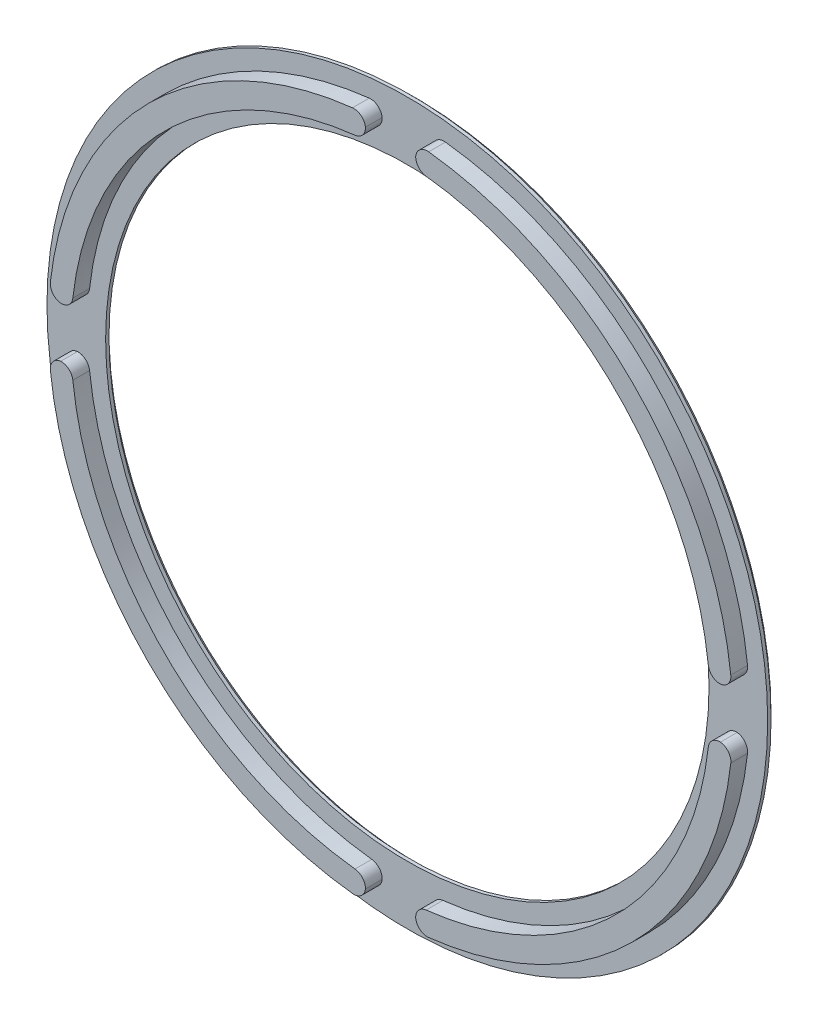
ISO-10303-21;
HEADER;
FILE_DESCRIPTION(('STEP AP214'),'2;1');
FILE_NAME('part.step','',(''),(''),'','','');
FILE_SCHEMA(('AUTOMOTIVE_DESIGN { 1 0 10303 214 1 1 1 1 }'));
ENDSEC;
DATA;
#1=APPLICATION_CONTEXT('core data for automotive mechanical design processes');
#2=APPLICATION_PROTOCOL_DEFINITION('international standard','automotive_design',2000,#1);
#3=PRODUCT_CONTEXT('',#1,'mechanical');
#4=PRODUCT('Part','Part','',(#3));
#5=PRODUCT_RELATED_PRODUCT_CATEGORY('part','',(#4));
#6=PRODUCT_DEFINITION_FORMATION('','',#4);
#7=PRODUCT_DEFINITION_CONTEXT('part definition',#1,'design');
#8=PRODUCT_DEFINITION('design','',#6,#7);
#9=PRODUCT_DEFINITION_SHAPE('','',#8);
#10=(LENGTH_UNIT() NAMED_UNIT(*) SI_UNIT(.MILLI.,.METRE.));
#11=(NAMED_UNIT(*) PLANE_ANGLE_UNIT() SI_UNIT($,.RADIAN.));
#12=(NAMED_UNIT(*) SI_UNIT($,.STERADIAN.) SOLID_ANGLE_UNIT());
#13=UNCERTAINTY_MEASURE_WITH_UNIT(LENGTH_MEASURE(1.E-05),#10,'distance_accuracy_value','');
#14=(GEOMETRIC_REPRESENTATION_CONTEXT(3) GLOBAL_UNCERTAINTY_ASSIGNED_CONTEXT((#13)) GLOBAL_UNIT_ASSIGNED_CONTEXT((#10,
#11,#12)) REPRESENTATION_CONTEXT('',''));
#15=CARTESIAN_POINT('',(0.,0.,0.));
#16=DIRECTION('',(0.,0.,1.));
#17=DIRECTION('',(1.,0.,0.));
#18=AXIS2_PLACEMENT_3D('',#15,#16,#17);
#19=CARTESIAN_POINT('',(0.,0.,0.9));
#20=DIRECTION('',(0.,0.,1.));
#21=DIRECTION('',(1.,0.,0.));
#22=AXIS2_PLACEMENT_3D('',#19,#20,#21);
#23=PLANE('',#22);
#24=CARTESIAN_POINT('',(0.,0.,0.9));
#25=DIRECTION('',(0.,0.,1.));
#26=DIRECTION('',(1.,0.,0.));
#27=AXIS2_PLACEMENT_3D('',#24,#25,#26);
#28=CIRCLE('',#27,43.);
#29=CARTESIAN_POINT('',(43.,0.,0.9));
#30=VERTEX_POINT('',#29);
#31=EDGE_CURVE('E381',#30,#30,#28,.T.);
#32=ORIENTED_EDGE('',*,*,#31,.T.);
#33=EDGE_LOOP('',(#32));
#34=FACE_BOUND('',#33,.T.);
#35=CARTESIAN_POINT('',(0.,0.,0.9));
#36=DIRECTION('',(0.,0.,1.));
#37=DIRECTION('',(1.,0.,0.));
#38=AXIS2_PLACEMENT_3D('',#35,#36,#37);
#39=CIRCLE('',#38,36.);
#40=CARTESIAN_POINT('',(36.,0.,0.9));
#41=VERTEX_POINT('',#40);
#42=EDGE_CURVE('E369',#41,#41,#39,.T.);
#43=ORIENTED_EDGE('',*,*,#42,.F.);
#44=EDGE_LOOP('',(#43));
#45=FACE_BOUND('',#44,.T.);
#46=CARTESIAN_POINT('',(39.2049488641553,4.39027158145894,0.9));
#47=DIRECTION('',(0.,0.,1.));
#48=DIRECTION('',(1.,0.,0.));
#49=AXIS2_PLACEMENT_3D('',#46,#47,#48);
#50=CIRCLE('',#49,1.4);
#51=CARTESIAN_POINT('',(40.5962524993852,4.54607336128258,0.9));
#52=VERTEX_POINT('',#51);
#53=CARTESIAN_POINT('',(39.3610969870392,2.99900677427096,0.9));
#54=VERTEX_POINT('',#53);
#55=EDGE_CURVE('E63',#52,#54,#50,.F.);
#56=ORIENTED_EDGE('',*,*,#55,.T.);
#57=CARTESIAN_POINT('',(39.3047227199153,4.39787129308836,0.9));
#58=DIRECTION('',(0.,0.,1.));
#59=DIRECTION('',(1.,0.,0.));
#60=AXIS2_PLACEMENT_3D('',#57,#58,#59);
#61=CIRCLE('',#60,1.4);
#62=CARTESIAN_POINT('',(37.9134051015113,4.24219443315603,0.9));
#63=VERTEX_POINT('',#62);
#64=EDGE_CURVE('E50',#54,#63,#61,.F.);
#65=ORIENTED_EDGE('',*,*,#64,.T.);
#66=CARTESIAN_POINT('',(0.,0.,0.9));
#67=DIRECTION('',(0.,0.,1.));
#68=DIRECTION('',(1.,0.,0.));
#69=AXIS2_PLACEMENT_3D('',#66,#67,#68);
#70=CIRCLE('',#69,38.15);
#71=CARTESIAN_POINT('',(4.24219443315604,37.9134051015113,0.9));
#72=VERTEX_POINT('',#71);
#73=EDGE_CURVE('E371',#72,#63,#70,.F.);
#74=ORIENTED_EDGE('',*,*,#73,.F.);
#75=CARTESIAN_POINT('',(4.39787129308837,39.3047227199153,0.9));
#76=DIRECTION('',(0.,0.,1.));
#77=DIRECTION('',(1.,0.,0.));
#78=AXIS2_PLACEMENT_3D('',#75,#76,#77);
#79=CIRCLE('',#78,1.4);
#80=CARTESIAN_POINT('',(2.99900677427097,39.3610969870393,0.9));
#81=VERTEX_POINT('',#80);
#82=EDGE_CURVE('E11',#72,#81,#79,.F.);
#83=ORIENTED_EDGE('',*,*,#82,.T.);
#84=CARTESIAN_POINT('',(4.39027158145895,39.2049488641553,0.9));
#85=DIRECTION('',(0.,0.,1.));
#86=DIRECTION('',(1.,0.,0.));
#87=AXIS2_PLACEMENT_3D('',#84,#85,#86);
#88=CIRCLE('',#87,1.4);
#89=CARTESIAN_POINT('',(4.54607336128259,40.5962524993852,0.9));
#90=VERTEX_POINT('',#89);
#91=EDGE_CURVE('E322',#81,#90,#88,.F.);
#92=ORIENTED_EDGE('',*,*,#91,.T.);
#93=CARTESIAN_POINT('',(0.,0.,0.9));
#94=DIRECTION('',(0.,0.,1.));
#95=DIRECTION('',(1.,0.,0.));
#96=AXIS2_PLACEMENT_3D('',#93,#94,#95);
#97=CIRCLE('',#96,40.85);
#98=EDGE_CURVE('E366',#90,#52,#97,.F.);
#99=ORIENTED_EDGE('',*,*,#98,.T.);
#100=EDGE_LOOP('',(#56,#65,#74,#83,#92,#99));
#101=FACE_BOUND('',#100,.T.);
#102=CARTESIAN_POINT('',(4.39027158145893,-39.2049488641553,0.9));
#103=DIRECTION('',(0.,0.,1.));
#104=DIRECTION('',(1.,0.,0.));
#105=AXIS2_PLACEMENT_3D('',#102,#103,#104);
#106=CIRCLE('',#105,1.4);
#107=CARTESIAN_POINT('',(4.54607336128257,-40.5962524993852,0.9));
#108=VERTEX_POINT('',#107);
#109=CARTESIAN_POINT('',(2.99900677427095,-39.3610969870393,0.9));
#110=VERTEX_POINT('',#109);
#111=EDGE_CURVE('E313',#108,#110,#106,.F.);
#112=ORIENTED_EDGE('',*,*,#111,.T.);
#113=CARTESIAN_POINT('',(4.39787129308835,-39.3047227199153,0.9));
#114=DIRECTION('',(0.,0.,1.));
#115=DIRECTION('',(1.,0.,0.));
#116=AXIS2_PLACEMENT_3D('',#113,#114,#115);
#117=CIRCLE('',#116,1.4);
#118=CARTESIAN_POINT('',(4.24219443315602,-37.9134051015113,0.9));
#119=VERTEX_POINT('',#118);
#120=EDGE_CURVE('E319',#110,#119,#117,.F.);
#121=ORIENTED_EDGE('',*,*,#120,.T.);
#122=CARTESIAN_POINT('',(0.,0.,0.9));
#123=DIRECTION('',(0.,0.,1.));
#124=DIRECTION('',(1.,0.,0.));
#125=AXIS2_PLACEMENT_3D('',#122,#123,#124);
#126=CIRCLE('',#125,38.15);
#127=CARTESIAN_POINT('',(37.9134051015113,-4.24219443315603,0.9));
#128=VERTEX_POINT('',#127);
#129=EDGE_CURVE('E453',#128,#119,#126,.F.);
#130=ORIENTED_EDGE('',*,*,#129,.F.);
#131=CARTESIAN_POINT('',(39.3047227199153,-4.39787129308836,0.9));
#132=DIRECTION('',(0.,0.,1.));
#133=DIRECTION('',(1.,0.,0.));
#134=AXIS2_PLACEMENT_3D('',#131,#132,#133);
#135=CIRCLE('',#134,1.4);
#136=CARTESIAN_POINT('',(39.3610969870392,-2.99900677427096,0.9));
#137=VERTEX_POINT('',#136);
#138=EDGE_CURVE('E317',#128,#137,#135,.F.);
#139=ORIENTED_EDGE('',*,*,#138,.T.);
#140=CARTESIAN_POINT('',(39.2049488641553,-4.39027158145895,0.9));
#141=DIRECTION('',(0.,0.,1.));
#142=DIRECTION('',(1.,0.,0.));
#143=AXIS2_PLACEMENT_3D('',#140,#141,#142);
#144=CIRCLE('',#143,1.4);
#145=CARTESIAN_POINT('',(40.5962524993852,-4.54607336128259,0.9));
#146=VERTEX_POINT('',#145);
#147=EDGE_CURVE('E315',#137,#146,#144,.F.);
#148=ORIENTED_EDGE('',*,*,#147,.T.);
#149=CARTESIAN_POINT('',(0.,0.,0.9));
#150=DIRECTION('',(0.,0.,1.));
#151=DIRECTION('',(1.,0.,0.));
#152=AXIS2_PLACEMENT_3D('',#149,#150,#151);
#153=CIRCLE('',#152,40.85);
#154=EDGE_CURVE('E374',#146,#108,#153,.F.);
#155=ORIENTED_EDGE('',*,*,#154,.T.);
#156=EDGE_LOOP('',(#112,#121,#130,#139,#148,#155));
#157=FACE_BOUND('',#156,.T.);
#158=CARTESIAN_POINT('',(-39.2049488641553,-4.39027158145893,0.9));
#159=DIRECTION('',(0.,0.,1.));
#160=DIRECTION('',(1.,0.,0.));
#161=AXIS2_PLACEMENT_3D('',#158,#159,#160);
#162=CIRCLE('',#161,1.4);
#163=CARTESIAN_POINT('',(-40.5962524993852,-4.54607336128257,0.9));
#164=VERTEX_POINT('',#163);
#165=CARTESIAN_POINT('',(-39.3610969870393,-2.99900677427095,0.9));
#166=VERTEX_POINT('',#165);
#167=EDGE_CURVE('E305',#164,#166,#162,.F.);
#168=ORIENTED_EDGE('',*,*,#167,.T.);
#169=CARTESIAN_POINT('',(-39.3047227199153,-4.39787129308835,0.9));
#170=DIRECTION('',(0.,0.,1.));
#171=DIRECTION('',(1.,0.,0.));
#172=AXIS2_PLACEMENT_3D('',#169,#170,#171);
#173=CIRCLE('',#172,1.4);
#174=CARTESIAN_POINT('',(-37.9134051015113,-4.24219443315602,0.9));
#175=VERTEX_POINT('',#174);
#176=EDGE_CURVE('E311',#166,#175,#173,.F.);
#177=ORIENTED_EDGE('',*,*,#176,.T.);
#178=CARTESIAN_POINT('',(0.,0.,0.9));
#179=DIRECTION('',(0.,0.,1.));
#180=DIRECTION('',(1.,0.,0.));
#181=AXIS2_PLACEMENT_3D('',#178,#179,#180);
#182=CIRCLE('',#181,38.15);
#183=CARTESIAN_POINT('',(-4.24219443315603,-37.9134051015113,0.9));
#184=VERTEX_POINT('',#183);
#185=EDGE_CURVE('E459',#184,#175,#182,.F.);
#186=ORIENTED_EDGE('',*,*,#185,.F.);
#187=CARTESIAN_POINT('',(-4.39787129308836,-39.3047227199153,0.9));
#188=DIRECTION('',(0.,0.,1.));
#189=DIRECTION('',(1.,0.,0.));
#190=AXIS2_PLACEMENT_3D('',#187,#188,#189);
#191=CIRCLE('',#190,1.4);
#192=CARTESIAN_POINT('',(-2.99900677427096,-39.3610969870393,0.9));
#193=VERTEX_POINT('',#192);
#194=EDGE_CURVE('E309',#184,#193,#191,.F.);
#195=ORIENTED_EDGE('',*,*,#194,.T.);
#196=CARTESIAN_POINT('',(-4.39027158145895,-39.2049488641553,0.9));
#197=DIRECTION('',(0.,0.,1.));
#198=DIRECTION('',(1.,0.,0.));
#199=AXIS2_PLACEMENT_3D('',#196,#197,#198);
#200=CIRCLE('',#199,1.4);
#201=CARTESIAN_POINT('',(-4.54607336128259,-40.5962524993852,0.9));
#202=VERTEX_POINT('',#201);
#203=EDGE_CURVE('E307',#193,#202,#200,.F.);
#204=ORIENTED_EDGE('',*,*,#203,.T.);
#205=CARTESIAN_POINT('',(0.,0.,0.9));
#206=DIRECTION('',(0.,0.,1.));
#207=DIRECTION('',(1.,0.,0.));
#208=AXIS2_PLACEMENT_3D('',#205,#206,#207);
#209=CIRCLE('',#208,40.85);
#210=EDGE_CURVE('E434',#202,#164,#209,.F.);
#211=ORIENTED_EDGE('',*,*,#210,.T.);
#212=EDGE_LOOP('',(#168,#177,#186,#195,#204,#211));
#213=FACE_BOUND('',#212,.T.);
#214=CARTESIAN_POINT('',(-4.39027158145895,39.2049488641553,0.9));
#215=DIRECTION('',(0.,0.,1.));
#216=DIRECTION('',(1.,0.,0.));
#217=AXIS2_PLACEMENT_3D('',#214,#215,#216);
#218=CIRCLE('',#217,1.4);
#219=CARTESIAN_POINT('',(-4.54607336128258,40.5962524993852,0.9));
#220=VERTEX_POINT('',#219);
#221=CARTESIAN_POINT('',(-2.99900677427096,39.3610969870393,0.9));
#222=VERTEX_POINT('',#221);
#223=EDGE_CURVE('E212',#220,#222,#218,.F.);
#224=ORIENTED_EDGE('',*,*,#223,.T.);
#225=CARTESIAN_POINT('',(-4.39787129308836,39.3047227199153,0.9));
#226=DIRECTION('',(0.,0.,1.));
#227=DIRECTION('',(1.,0.,0.));
#228=AXIS2_PLACEMENT_3D('',#225,#226,#227);
#229=CIRCLE('',#228,1.4);
#230=CARTESIAN_POINT('',(-4.24219443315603,37.9134051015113,0.9));
#231=VERTEX_POINT('',#230);
#232=EDGE_CURVE('E303',#222,#231,#229,.F.);
#233=ORIENTED_EDGE('',*,*,#232,.T.);
#234=CARTESIAN_POINT('',(0.,0.,0.9));
#235=DIRECTION('',(0.,0.,1.));
#236=DIRECTION('',(1.,0.,0.));
#237=AXIS2_PLACEMENT_3D('',#234,#235,#236);
#238=CIRCLE('',#237,38.15);
#239=CARTESIAN_POINT('',(-37.9134051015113,4.24219443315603,0.9));
#240=VERTEX_POINT('',#239);
#241=EDGE_CURVE('E224',#240,#231,#238,.F.);
#242=ORIENTED_EDGE('',*,*,#241,.F.);
#243=CARTESIAN_POINT('',(-39.3047227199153,4.39787129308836,0.9));
#244=DIRECTION('',(0.,0.,1.));
#245=DIRECTION('',(1.,0.,0.));
#246=AXIS2_PLACEMENT_3D('',#243,#244,#245);
#247=CIRCLE('',#246,1.4);
#248=CARTESIAN_POINT('',(-39.3610969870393,2.99900677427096,0.9));
#249=VERTEX_POINT('',#248);
#250=EDGE_CURVE('E207',#240,#249,#247,.F.);
#251=ORIENTED_EDGE('',*,*,#250,.T.);
#252=CARTESIAN_POINT('',(-39.2049488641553,4.39027158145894,0.9));
#253=DIRECTION('',(0.,0.,1.));
#254=DIRECTION('',(1.,0.,0.));
#255=AXIS2_PLACEMENT_3D('',#252,#253,#254);
#256=CIRCLE('',#255,1.4);
#257=CARTESIAN_POINT('',(-40.5962524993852,4.54607336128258,0.9));
#258=VERTEX_POINT('',#257);
#259=EDGE_CURVE('E202',#249,#258,#256,.F.);
#260=ORIENTED_EDGE('',*,*,#259,.T.);
#261=CARTESIAN_POINT('',(0.,0.,0.9));
#262=DIRECTION('',(0.,0.,1.));
#263=DIRECTION('',(1.,0.,0.));
#264=AXIS2_PLACEMENT_3D('',#261,#262,#263);
#265=CIRCLE('',#264,40.85);
#266=EDGE_CURVE('E204',#258,#220,#265,.F.);
#267=ORIENTED_EDGE('',*,*,#266,.T.);
#268=EDGE_LOOP('',(#224,#233,#242,#251,#260,#267));
#269=FACE_BOUND('',#268,.T.);
#270=ADVANCED_FACE('F41',(#34,#45,#101,#157,#213,#269),#23,.T.);
#271=CARTESIAN_POINT('',(0.,0.,0.));
#272=DIRECTION('',(0.,0.,1.));
#273=DIRECTION('',(1.,0.,0.));
#274=AXIS2_PLACEMENT_3D('',#271,#272,#273);
#275=PLANE('',#274);
#276=CARTESIAN_POINT('',(0.,0.,0.));
#277=DIRECTION('',(0.,0.,1.));
#278=DIRECTION('',(1.,0.,0.));
#279=AXIS2_PLACEMENT_3D('',#276,#277,#278);
#280=CIRCLE('',#279,36.5);
#281=CARTESIAN_POINT('',(36.5,0.,0.));
#282=VERTEX_POINT('',#281);
#283=EDGE_CURVE('E387',#282,#282,#280,.T.);
#284=ORIENTED_EDGE('',*,*,#283,.T.);
#285=EDGE_LOOP('',(#284));
#286=FACE_BOUND('',#285,.T.);
#287=CARTESIAN_POINT('',(0.,0.,0.));
#288=DIRECTION('',(0.,0.,1.));
#289=DIRECTION('',(1.,0.,0.));
#290=AXIS2_PLACEMENT_3D('',#287,#288,#289);
#291=CIRCLE('',#290,42.5);
#292=CARTESIAN_POINT('',(42.5,0.,0.));
#293=VERTEX_POINT('',#292);
#294=EDGE_CURVE('E384',#293,#293,#291,.F.);
#295=ORIENTED_EDGE('',*,*,#294,.T.);
#296=EDGE_LOOP('',(#295));
#297=FACE_BOUND('',#296,.T.);
#298=ADVANCED_FACE('F403',(#286,#297),#275,.F.);
#299=CARTESIAN_POINT('',(0.,0.,0.9));
#300=DIRECTION('',(0.,0.,-1.));
#301=DIRECTION('',(-1.,0.,0.));
#302=AXIS2_PLACEMENT_3D('',#299,#300,#301);
#303=CYLINDRICAL_SURFACE('',#302,43.);
#304=CARTESIAN_POINT('',(0.,0.,0.500000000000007));
#305=DIRECTION('',(0.,0.,1.));
#306=DIRECTION('',(1.,0.,0.));
#307=AXIS2_PLACEMENT_3D('',#304,#305,#306);
#308=CIRCLE('',#307,43.);
#309=CARTESIAN_POINT('',(43.,0.,0.500000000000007));
#310=VERTEX_POINT('',#309);
#311=EDGE_CURVE('E228',#310,#310,#308,.T.);
#312=ORIENTED_EDGE('',*,*,#311,.T.);
#313=EDGE_LOOP('',(#312));
#314=FACE_BOUND('',#313,.T.);
#315=ORIENTED_EDGE('',*,*,#31,.F.);
#316=EDGE_LOOP('',(#315));
#317=FACE_BOUND('',#316,.T.);
#318=ADVANCED_FACE('F406',(#314,#317),#303,.T.);
#319=CARTESIAN_POINT('',(0.,0.,0.9));
#320=DIRECTION('',(0.,0.,-1.));
#321=DIRECTION('',(-1.,0.,0.));
#322=AXIS2_PLACEMENT_3D('',#319,#320,#321);
#323=CYLINDRICAL_SURFACE('',#322,36.);
#324=CARTESIAN_POINT('',(0.,0.,0.499999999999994));
#325=DIRECTION('',(0.,0.,1.));
#326=DIRECTION('',(1.,0.,0.));
#327=AXIS2_PLACEMENT_3D('',#324,#325,#326);
#328=CIRCLE('',#327,36.);
#329=CARTESIAN_POINT('',(36.,0.,0.499999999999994));
#330=VERTEX_POINT('',#329);
#331=EDGE_CURVE('E233',#330,#330,#328,.F.);
#332=ORIENTED_EDGE('',*,*,#331,.T.);
#333=EDGE_LOOP('',(#332));
#334=FACE_BOUND('',#333,.T.);
#335=ORIENTED_EDGE('',*,*,#42,.T.);
#336=EDGE_LOOP('',(#335));
#337=FACE_BOUND('',#336,.T.);
#338=ADVANCED_FACE('F392',(#334,#337),#323,.F.);
#339=CARTESIAN_POINT('',(0.,0.,2.9));
#340=DIRECTION('',(0.,0.,-1.));
#341=DIRECTION('',(-1.,0.,0.));
#342=AXIS2_PLACEMENT_3D('',#339,#340,#341);
#343=CYLINDRICAL_SURFACE('',#342,38.15);
#344=ORIENTED_EDGE('',*,*,#73,.T.);
#345=DIRECTION('',(0.,0.,-1.));
#346=VECTOR('',#345,1.);
#347=CARTESIAN_POINT('',(37.9134051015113,4.24219443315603,2.9));
#348=LINE('',#347,#346);
#349=CARTESIAN_POINT('',(37.9134051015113,4.24219443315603,2.9));
#350=VERTEX_POINT('',#349);
#351=EDGE_CURVE('E299',#63,#350,#348,.F.);
#352=ORIENTED_EDGE('',*,*,#351,.T.);
#353=CARTESIAN_POINT('',(0.,0.,2.9));
#354=DIRECTION('',(0.,0.,1.));
#355=DIRECTION('',(1.,0.,0.));
#356=AXIS2_PLACEMENT_3D('',#353,#354,#355);
#357=CIRCLE('',#356,38.15);
#358=CARTESIAN_POINT('',(4.24219443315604,37.9134051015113,2.9));
#359=VERTEX_POINT('',#358);
#360=EDGE_CURVE('E358',#359,#350,#357,.F.);
#361=ORIENTED_EDGE('',*,*,#360,.F.);
#362=DIRECTION('',(0.,0.,-1.));
#363=VECTOR('',#362,1.);
#364=CARTESIAN_POINT('',(4.24219443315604,37.9134051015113,2.9));
#365=LINE('',#364,#363);
#366=EDGE_CURVE('E297',#359,#72,#365,.T.);
#367=ORIENTED_EDGE('',*,*,#366,.T.);
#368=EDGE_LOOP('',(#344,#352,#361,#367));
#369=FACE_BOUND('',#368,.T.);
#370=ADVANCED_FACE('F363',(#369),#343,.F.);
#371=CARTESIAN_POINT('',(0.,0.,2.9));
#372=DIRECTION('',(0.,0.,-1.));
#373=DIRECTION('',(-1.,0.,0.));
#374=AXIS2_PLACEMENT_3D('',#371,#372,#373);
#375=CYLINDRICAL_SURFACE('',#374,40.85);
#376=CARTESIAN_POINT('',(0.,0.,2.9));
#377=DIRECTION('',(0.,0.,1.));
#378=DIRECTION('',(1.,0.,0.));
#379=AXIS2_PLACEMENT_3D('',#376,#377,#378);
#380=CIRCLE('',#379,40.85);
#381=CARTESIAN_POINT('',(4.54607336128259,40.5962524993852,2.9));
#382=VERTEX_POINT('',#381);
#383=CARTESIAN_POINT('',(40.5962524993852,4.54607336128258,2.9));
#384=VERTEX_POINT('',#383);
#385=EDGE_CURVE('E365',#382,#384,#380,.F.);
#386=ORIENTED_EDGE('',*,*,#385,.T.);
#387=DIRECTION('',(0.,0.,-1.));
#388=VECTOR('',#387,1.);
#389=CARTESIAN_POINT('',(40.5962524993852,4.54607336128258,2.9));
#390=LINE('',#389,#388);
#391=EDGE_CURVE('E286',#384,#52,#390,.T.);
#392=ORIENTED_EDGE('',*,*,#391,.T.);
#393=ORIENTED_EDGE('',*,*,#98,.F.);
#394=DIRECTION('',(0.,0.,-1.));
#395=VECTOR('',#394,1.);
#396=CARTESIAN_POINT('',(4.54607336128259,40.5962524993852,2.9));
#397=LINE('',#396,#395);
#398=EDGE_CURVE('E283',#90,#382,#397,.F.);
#399=ORIENTED_EDGE('',*,*,#398,.T.);
#400=EDGE_LOOP('',(#386,#392,#393,#399));
#401=FACE_BOUND('',#400,.T.);
#402=ADVANCED_FACE('F512',(#401),#375,.T.);
#403=CARTESIAN_POINT('',(0.,0.,2.9));
#404=DIRECTION('',(0.,0.,1.));
#405=DIRECTION('',(1.,0.,0.));
#406=AXIS2_PLACEMENT_3D('',#403,#404,#405);
#407=PLANE('',#406);
#408=CARTESIAN_POINT('',(39.3047227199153,4.39787129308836,2.9));
#409=DIRECTION('',(0.,0.,1.));
#410=DIRECTION('',(1.,0.,0.));
#411=AXIS2_PLACEMENT_3D('',#408,#409,#410);
#412=CIRCLE('',#411,1.4);
#413=CARTESIAN_POINT('',(39.3610969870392,2.99900677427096,2.9));
#414=VERTEX_POINT('',#413);
#415=EDGE_CURVE('E293',#350,#414,#412,.T.);
#416=ORIENTED_EDGE('',*,*,#415,.T.);
#417=CARTESIAN_POINT('',(39.2049488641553,4.39027158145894,2.9));
#418=DIRECTION('',(0.,0.,1.));
#419=DIRECTION('',(1.,0.,0.));
#420=AXIS2_PLACEMENT_3D('',#417,#418,#419);
#421=CIRCLE('',#420,1.4);
#422=EDGE_CURVE('E295',#414,#384,#421,.T.);
#423=ORIENTED_EDGE('',*,*,#422,.T.);
#424=ORIENTED_EDGE('',*,*,#385,.F.);
#425=CARTESIAN_POINT('',(4.39027158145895,39.2049488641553,2.9));
#426=DIRECTION('',(0.,0.,1.));
#427=DIRECTION('',(1.,0.,0.));
#428=AXIS2_PLACEMENT_3D('',#425,#426,#427);
#429=CIRCLE('',#428,1.4);
#430=CARTESIAN_POINT('',(2.99900677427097,39.3610969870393,2.9));
#431=VERTEX_POINT('',#430);
#432=EDGE_CURVE('E291',#382,#431,#429,.T.);
#433=ORIENTED_EDGE('',*,*,#432,.T.);
#434=CARTESIAN_POINT('',(4.39787129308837,39.3047227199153,2.9));
#435=DIRECTION('',(0.,0.,1.));
#436=DIRECTION('',(1.,0.,0.));
#437=AXIS2_PLACEMENT_3D('',#434,#435,#436);
#438=CIRCLE('',#437,1.4);
#439=EDGE_CURVE('E289',#431,#359,#438,.T.);
#440=ORIENTED_EDGE('',*,*,#439,.T.);
#441=ORIENTED_EDGE('',*,*,#360,.T.);
#442=EDGE_LOOP('',(#416,#423,#424,#433,#440,#441));
#443=FACE_BOUND('',#442,.T.);
#444=ADVANCED_FACE('F357',(#443),#407,.T.);
#445=CARTESIAN_POINT('',(0.,0.,2.9));
#446=DIRECTION('',(0.,0.,-1.));
#447=DIRECTION('',(-1.,0.,0.));
#448=AXIS2_PLACEMENT_3D('',#445,#446,#447);
#449=CYLINDRICAL_SURFACE('',#448,38.15);
#450=CARTESIAN_POINT('',(0.,0.,2.9));
#451=DIRECTION('',(0.,0.,1.));
#452=DIRECTION('',(1.,0.,0.));
#453=AXIS2_PLACEMENT_3D('',#450,#451,#452);
#454=CIRCLE('',#453,38.15);
#455=CARTESIAN_POINT('',(37.9134051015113,-4.24219443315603,2.9));
#456=VERTEX_POINT('',#455);
#457=CARTESIAN_POINT('',(4.24219443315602,-37.9134051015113,2.9));
#458=VERTEX_POINT('',#457);
#459=EDGE_CURVE('E463',#456,#458,#454,.F.);
#460=ORIENTED_EDGE('',*,*,#459,.F.);
#461=DIRECTION('',(0.,0.,-1.));
#462=VECTOR('',#461,1.);
#463=CARTESIAN_POINT('',(37.9134051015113,-4.24219443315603,2.9));
#464=LINE('',#463,#462);
#465=EDGE_CURVE('E281',#456,#128,#464,.T.);
#466=ORIENTED_EDGE('',*,*,#465,.T.);
#467=ORIENTED_EDGE('',*,*,#129,.T.);
#468=DIRECTION('',(0.,0.,-1.));
#469=VECTOR('',#468,1.);
#470=CARTESIAN_POINT('',(4.24219443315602,-37.9134051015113,2.9));
#471=LINE('',#470,#469);
#472=EDGE_CURVE('E279',#119,#458,#471,.F.);
#473=ORIENTED_EDGE('',*,*,#472,.T.);
#474=EDGE_LOOP('',(#460,#466,#467,#473));
#475=FACE_BOUND('',#474,.T.);
#476=ADVANCED_FACE('F486',(#475),#449,.F.);
#477=CARTESIAN_POINT('',(0.,0.,2.9));
#478=DIRECTION('',(0.,0.,-1.));
#479=DIRECTION('',(-1.,0.,0.));
#480=AXIS2_PLACEMENT_3D('',#477,#478,#479);
#481=CYLINDRICAL_SURFACE('',#480,40.85);
#482=CARTESIAN_POINT('',(0.,0.,2.9));
#483=DIRECTION('',(0.,0.,1.));
#484=DIRECTION('',(1.,0.,0.));
#485=AXIS2_PLACEMENT_3D('',#482,#483,#484);
#486=CIRCLE('',#485,40.85);
#487=CARTESIAN_POINT('',(40.5962524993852,-4.54607336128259,2.9));
#488=VERTEX_POINT('',#487);
#489=CARTESIAN_POINT('',(4.54607336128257,-40.5962524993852,2.9));
#490=VERTEX_POINT('',#489);
#491=EDGE_CURVE('E377',#488,#490,#486,.F.);
#492=ORIENTED_EDGE('',*,*,#491,.T.);
#493=DIRECTION('',(0.,0.,-1.));
#494=VECTOR('',#493,1.);
#495=CARTESIAN_POINT('',(4.54607336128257,-40.5962524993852,2.9));
#496=LINE('',#495,#494);
#497=EDGE_CURVE('E268',#490,#108,#496,.T.);
#498=ORIENTED_EDGE('',*,*,#497,.T.);
#499=ORIENTED_EDGE('',*,*,#154,.F.);
#500=DIRECTION('',(0.,0.,-1.));
#501=VECTOR('',#500,1.);
#502=CARTESIAN_POINT('',(40.5962524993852,-4.54607336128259,2.9));
#503=LINE('',#502,#501);
#504=EDGE_CURVE('E265',#146,#488,#503,.F.);
#505=ORIENTED_EDGE('',*,*,#504,.T.);
#506=EDGE_LOOP('',(#492,#498,#499,#505));
#507=FACE_BOUND('',#506,.T.);
#508=ADVANCED_FACE('F470',(#507),#481,.T.);
#509=CARTESIAN_POINT('',(0.,0.,2.9));
#510=DIRECTION('',(0.,0.,1.));
#511=DIRECTION('',(1.,0.,0.));
#512=AXIS2_PLACEMENT_3D('',#509,#510,#511);
#513=PLANE('',#512);
#514=ORIENTED_EDGE('',*,*,#491,.F.);
#515=CARTESIAN_POINT('',(39.2049488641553,-4.39027158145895,2.9));
#516=DIRECTION('',(0.,0.,1.));
#517=DIRECTION('',(1.,0.,0.));
#518=AXIS2_PLACEMENT_3D('',#515,#516,#517);
#519=CIRCLE('',#518,1.4);
#520=CARTESIAN_POINT('',(39.3610969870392,-2.99900677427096,2.9));
#521=VERTEX_POINT('',#520);
#522=EDGE_CURVE('E277',#488,#521,#519,.T.);
#523=ORIENTED_EDGE('',*,*,#522,.T.);
#524=CARTESIAN_POINT('',(39.3047227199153,-4.39787129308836,2.9));
#525=DIRECTION('',(0.,0.,1.));
#526=DIRECTION('',(1.,0.,0.));
#527=AXIS2_PLACEMENT_3D('',#524,#525,#526);
#528=CIRCLE('',#527,1.4);
#529=EDGE_CURVE('E275',#521,#456,#528,.T.);
#530=ORIENTED_EDGE('',*,*,#529,.T.);
#531=ORIENTED_EDGE('',*,*,#459,.T.);
#532=CARTESIAN_POINT('',(4.39787129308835,-39.3047227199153,2.9));
#533=DIRECTION('',(0.,0.,1.));
#534=DIRECTION('',(1.,0.,0.));
#535=AXIS2_PLACEMENT_3D('',#532,#533,#534);
#536=CIRCLE('',#535,1.4);
#537=CARTESIAN_POINT('',(2.99900677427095,-39.3610969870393,2.9));
#538=VERTEX_POINT('',#537);
#539=EDGE_CURVE('E271',#458,#538,#536,.T.);
#540=ORIENTED_EDGE('',*,*,#539,.T.);
#541=CARTESIAN_POINT('',(4.39027158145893,-39.2049488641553,2.9));
#542=DIRECTION('',(0.,0.,1.));
#543=DIRECTION('',(1.,0.,0.));
#544=AXIS2_PLACEMENT_3D('',#541,#542,#543);
#545=CIRCLE('',#544,1.4);
#546=EDGE_CURVE('E273',#538,#490,#545,.T.);
#547=ORIENTED_EDGE('',*,*,#546,.T.);
#548=EDGE_LOOP('',(#514,#523,#530,#531,#540,#547));
#549=FACE_BOUND('',#548,.T.);
#550=ADVANCED_FACE('F495',(#549),#513,.T.);
#551=CARTESIAN_POINT('',(0.,0.,2.9));
#552=DIRECTION('',(0.,0.,-1.));
#553=DIRECTION('',(-1.,0.,0.));
#554=AXIS2_PLACEMENT_3D('',#551,#552,#553);
#555=CYLINDRICAL_SURFACE('',#554,38.15);
#556=CARTESIAN_POINT('',(0.,0.,2.9));
#557=DIRECTION('',(0.,0.,1.));
#558=DIRECTION('',(1.,0.,0.));
#559=AXIS2_PLACEMENT_3D('',#556,#557,#558);
#560=CIRCLE('',#559,38.15);
#561=CARTESIAN_POINT('',(-4.24219443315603,-37.9134051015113,2.9));
#562=VERTEX_POINT('',#561);
#563=CARTESIAN_POINT('',(-37.9134051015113,-4.24219443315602,2.9));
#564=VERTEX_POINT('',#563);
#565=EDGE_CURVE('E454',#562,#564,#560,.F.);
#566=ORIENTED_EDGE('',*,*,#565,.F.);
#567=DIRECTION('',(0.,0.,-1.));
#568=VECTOR('',#567,1.);
#569=CARTESIAN_POINT('',(-4.24219443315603,-37.9134051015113,2.9));
#570=LINE('',#569,#568);
#571=EDGE_CURVE('E263',#562,#184,#570,.T.);
#572=ORIENTED_EDGE('',*,*,#571,.T.);
#573=ORIENTED_EDGE('',*,*,#185,.T.);
#574=DIRECTION('',(0.,0.,-1.));
#575=VECTOR('',#574,1.);
#576=CARTESIAN_POINT('',(-37.9134051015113,-4.24219443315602,2.9));
#577=LINE('',#576,#575);
#578=EDGE_CURVE('E261',#175,#564,#577,.F.);
#579=ORIENTED_EDGE('',*,*,#578,.T.);
#580=EDGE_LOOP('',(#566,#572,#573,#579));
#581=FACE_BOUND('',#580,.T.);
#582=ADVANCED_FACE('F497',(#581),#555,.F.);
#583=CARTESIAN_POINT('',(0.,0.,2.9));
#584=DIRECTION('',(0.,0.,-1.));
#585=DIRECTION('',(-1.,0.,0.));
#586=AXIS2_PLACEMENT_3D('',#583,#584,#585);
#587=CYLINDRICAL_SURFACE('',#586,40.85);
#588=CARTESIAN_POINT('',(0.,0.,2.9));
#589=DIRECTION('',(0.,0.,1.));
#590=DIRECTION('',(1.,0.,0.));
#591=AXIS2_PLACEMENT_3D('',#588,#589,#590);
#592=CIRCLE('',#591,40.85);
#593=CARTESIAN_POINT('',(-4.54607336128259,-40.5962524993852,2.9));
#594=VERTEX_POINT('',#593);
#595=CARTESIAN_POINT('',(-40.5962524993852,-4.54607336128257,2.9));
#596=VERTEX_POINT('',#595);
#597=EDGE_CURVE('E448',#594,#596,#592,.F.);
#598=ORIENTED_EDGE('',*,*,#597,.T.);
#599=DIRECTION('',(0.,0.,-1.));
#600=VECTOR('',#599,1.);
#601=CARTESIAN_POINT('',(-40.5962524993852,-4.54607336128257,2.9));
#602=LINE('',#601,#600);
#603=EDGE_CURVE('E250',#596,#164,#602,.T.);
#604=ORIENTED_EDGE('',*,*,#603,.T.);
#605=ORIENTED_EDGE('',*,*,#210,.F.);
#606=DIRECTION('',(0.,0.,-1.));
#607=VECTOR('',#606,1.);
#608=CARTESIAN_POINT('',(-4.54607336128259,-40.5962524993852,2.9));
#609=LINE('',#608,#607);
#610=EDGE_CURVE('E247',#202,#594,#609,.F.);
#611=ORIENTED_EDGE('',*,*,#610,.T.);
#612=EDGE_LOOP('',(#598,#604,#605,#611));
#613=FACE_BOUND('',#612,.T.);
#614=ADVANCED_FACE('F451',(#613),#587,.T.);
#615=CARTESIAN_POINT('',(0.,0.,2.9));
#616=DIRECTION('',(0.,0.,1.));
#617=DIRECTION('',(1.,0.,0.));
#618=AXIS2_PLACEMENT_3D('',#615,#616,#617);
#619=PLANE('',#618);
#620=ORIENTED_EDGE('',*,*,#597,.F.);
#621=CARTESIAN_POINT('',(-4.39027158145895,-39.2049488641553,2.9));
#622=DIRECTION('',(0.,0.,1.));
#623=DIRECTION('',(1.,0.,0.));
#624=AXIS2_PLACEMENT_3D('',#621,#622,#623);
#625=CIRCLE('',#624,1.4);
#626=CARTESIAN_POINT('',(-2.99900677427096,-39.3610969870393,2.9));
#627=VERTEX_POINT('',#626);
#628=EDGE_CURVE('E259',#594,#627,#625,.T.);
#629=ORIENTED_EDGE('',*,*,#628,.T.);
#630=CARTESIAN_POINT('',(-4.39787129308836,-39.3047227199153,2.9));
#631=DIRECTION('',(0.,0.,1.));
#632=DIRECTION('',(1.,0.,0.));
#633=AXIS2_PLACEMENT_3D('',#630,#631,#632);
#634=CIRCLE('',#633,1.4);
#635=EDGE_CURVE('E257',#627,#562,#634,.T.);
#636=ORIENTED_EDGE('',*,*,#635,.T.);
#637=ORIENTED_EDGE('',*,*,#565,.T.);
#638=CARTESIAN_POINT('',(-39.3047227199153,-4.39787129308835,2.9));
#639=DIRECTION('',(0.,0.,1.));
#640=DIRECTION('',(1.,0.,0.));
#641=AXIS2_PLACEMENT_3D('',#638,#639,#640);
#642=CIRCLE('',#641,1.4);
#643=CARTESIAN_POINT('',(-39.3610969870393,-2.99900677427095,2.9));
#644=VERTEX_POINT('',#643);
#645=EDGE_CURVE('E253',#564,#644,#642,.T.);
#646=ORIENTED_EDGE('',*,*,#645,.T.);
#647=CARTESIAN_POINT('',(-39.2049488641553,-4.39027158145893,2.9));
#648=DIRECTION('',(0.,0.,1.));
#649=DIRECTION('',(1.,0.,0.));
#650=AXIS2_PLACEMENT_3D('',#647,#648,#649);
#651=CIRCLE('',#650,1.4);
#652=EDGE_CURVE('E255',#644,#596,#651,.T.);
#653=ORIENTED_EDGE('',*,*,#652,.T.);
#654=EDGE_LOOP('',(#620,#629,#636,#637,#646,#653));
#655=FACE_BOUND('',#654,.T.);
#656=ADVANCED_FACE('F447',(#655),#619,.T.);
#657=CARTESIAN_POINT('',(0.,0.,2.9));
#658=DIRECTION('',(0.,0.,-1.));
#659=DIRECTION('',(-1.,0.,0.));
#660=AXIS2_PLACEMENT_3D('',#657,#658,#659);
#661=CYLINDRICAL_SURFACE('',#660,38.15);
#662=CARTESIAN_POINT('',(0.,0.,2.9));
#663=DIRECTION('',(0.,0.,1.));
#664=DIRECTION('',(1.,0.,0.));
#665=AXIS2_PLACEMENT_3D('',#662,#663,#664);
#666=CIRCLE('',#665,38.15);
#667=CARTESIAN_POINT('',(-37.9134051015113,4.24219443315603,2.9));
#668=VERTEX_POINT('',#667);
#669=CARTESIAN_POINT('',(-4.24219443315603,37.9134051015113,2.9));
#670=VERTEX_POINT('',#669);
#671=EDGE_CURVE('E223',#668,#670,#666,.F.);
#672=ORIENTED_EDGE('',*,*,#671,.F.);
#673=DIRECTION('',(0.,0.,-1.));
#674=VECTOR('',#673,1.);
#675=CARTESIAN_POINT('',(-37.9134051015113,4.24219443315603,2.9));
#676=LINE('',#675,#674);
#677=EDGE_CURVE('E245',#668,#240,#676,.T.);
#678=ORIENTED_EDGE('',*,*,#677,.T.);
#679=ORIENTED_EDGE('',*,*,#241,.T.);
#680=DIRECTION('',(0.,0.,-1.));
#681=VECTOR('',#680,1.);
#682=CARTESIAN_POINT('',(-4.24219443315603,37.9134051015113,2.9));
#683=LINE('',#682,#681);
#684=EDGE_CURVE('E243',#231,#670,#683,.F.);
#685=ORIENTED_EDGE('',*,*,#684,.T.);
#686=EDGE_LOOP('',(#672,#678,#679,#685));
#687=FACE_BOUND('',#686,.T.);
#688=ADVANCED_FACE('F658',(#687),#661,.F.);
#689=CARTESIAN_POINT('',(0.,0.,2.9));
#690=DIRECTION('',(0.,0.,-1.));
#691=DIRECTION('',(-1.,0.,0.));
#692=AXIS2_PLACEMENT_3D('',#689,#690,#691);
#693=CYLINDRICAL_SURFACE('',#692,40.85);
#694=CARTESIAN_POINT('',(0.,0.,2.9));
#695=DIRECTION('',(0.,0.,1.));
#696=DIRECTION('',(1.,0.,0.));
#697=AXIS2_PLACEMENT_3D('',#694,#695,#696);
#698=CIRCLE('',#697,40.85);
#699=CARTESIAN_POINT('',(-40.5962524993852,4.54607336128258,2.9));
#700=VERTEX_POINT('',#699);
#701=CARTESIAN_POINT('',(-4.54607336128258,40.5962524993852,2.9));
#702=VERTEX_POINT('',#701);
#703=EDGE_CURVE('E461',#700,#702,#698,.F.);
#704=ORIENTED_EDGE('',*,*,#703,.T.);
#705=DIRECTION('',(0.,0.,-1.));
#706=VECTOR('',#705,1.);
#707=CARTESIAN_POINT('',(-4.54607336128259,40.5962524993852,2.9));
#708=LINE('',#707,#706);
#709=EDGE_CURVE('E222',#702,#220,#708,.T.);
#710=ORIENTED_EDGE('',*,*,#709,.T.);
#711=ORIENTED_EDGE('',*,*,#266,.F.);
#712=DIRECTION('',(0.,0.,-1.));
#713=VECTOR('',#712,1.);
#714=CARTESIAN_POINT('',(-40.5962524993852,4.54607336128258,2.9));
#715=LINE('',#714,#713);
#716=EDGE_CURVE('E219',#258,#700,#715,.F.);
#717=ORIENTED_EDGE('',*,*,#716,.T.);
#718=EDGE_LOOP('',(#704,#710,#711,#717));
#719=FACE_BOUND('',#718,.T.);
#720=ADVANCED_FACE('F218',(#719),#693,.T.);
#721=CARTESIAN_POINT('',(0.,0.,2.9));
#722=DIRECTION('',(0.,0.,1.));
#723=DIRECTION('',(1.,0.,0.));
#724=AXIS2_PLACEMENT_3D('',#721,#722,#723);
#725=PLANE('',#724);
#726=ORIENTED_EDGE('',*,*,#703,.F.);
#727=CARTESIAN_POINT('',(-39.2049488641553,4.39027158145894,2.9));
#728=DIRECTION('',(0.,0.,1.));
#729=DIRECTION('',(1.,0.,0.));
#730=AXIS2_PLACEMENT_3D('',#727,#728,#729);
#731=CIRCLE('',#730,1.4);
#732=CARTESIAN_POINT('',(-39.3610969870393,2.99900677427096,2.9));
#733=VERTEX_POINT('',#732);
#734=EDGE_CURVE('E227',#700,#733,#731,.T.);
#735=ORIENTED_EDGE('',*,*,#734,.T.);
#736=CARTESIAN_POINT('',(-39.3047227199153,4.39787129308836,2.9));
#737=DIRECTION('',(0.,0.,1.));
#738=DIRECTION('',(1.,0.,0.));
#739=AXIS2_PLACEMENT_3D('',#736,#737,#738);
#740=CIRCLE('',#739,1.4);
#741=EDGE_CURVE('E240',#733,#668,#740,.T.);
#742=ORIENTED_EDGE('',*,*,#741,.T.);
#743=ORIENTED_EDGE('',*,*,#671,.T.);
#744=CARTESIAN_POINT('',(-4.39787129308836,39.3047227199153,2.9));
#745=DIRECTION('',(0.,0.,1.));
#746=DIRECTION('',(1.,0.,0.));
#747=AXIS2_PLACEMENT_3D('',#744,#745,#746);
#748=CIRCLE('',#747,1.4);
#749=CARTESIAN_POINT('',(-2.99900677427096,39.3610969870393,2.9));
#750=VERTEX_POINT('',#749);
#751=EDGE_CURVE('E230',#670,#750,#748,.T.);
#752=ORIENTED_EDGE('',*,*,#751,.T.);
#753=CARTESIAN_POINT('',(-4.39027158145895,39.2049488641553,2.9));
#754=DIRECTION('',(0.,0.,1.));
#755=DIRECTION('',(1.,0.,0.));
#756=AXIS2_PLACEMENT_3D('',#753,#754,#755);
#757=CIRCLE('',#756,1.4);
#758=EDGE_CURVE('E238',#750,#702,#757,.T.);
#759=ORIENTED_EDGE('',*,*,#758,.T.);
#760=EDGE_LOOP('',(#726,#735,#742,#743,#752,#759));
#761=FACE_BOUND('',#760,.T.);
#762=ADVANCED_FACE('F399',(#761),#725,.T.);
#763=CARTESIAN_POINT('',(0.,0.,0.));
#764=DIRECTION('',(0.,0.,-1.));
#765=DIRECTION('',(-1.,0.,0.));
#766=AXIS2_PLACEMENT_3D('',#763,#764,#765);
#767=CONICAL_SURFACE('',#766,36.5,0.785398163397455);
#768=ORIENTED_EDGE('',*,*,#331,.F.);
#769=EDGE_LOOP('',(#768));
#770=FACE_BOUND('',#769,.T.);
#771=ORIENTED_EDGE('',*,*,#283,.F.);
#772=EDGE_LOOP('',(#771));
#773=FACE_BOUND('',#772,.T.);
#774=ADVANCED_FACE('F395',(#770,#773),#767,.F.);
#775=CARTESIAN_POINT('',(0.,0.,0.500000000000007));
#776=DIRECTION('',(0.,0.,1.));
#777=DIRECTION('',(1.,0.,0.));
#778=AXIS2_PLACEMENT_3D('',#775,#776,#777);
#779=CONICAL_SURFACE('',#778,43.,0.785398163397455);
#780=ORIENTED_EDGE('',*,*,#294,.F.);
#781=EDGE_LOOP('',(#780));
#782=FACE_BOUND('',#781,.T.);
#783=ORIENTED_EDGE('',*,*,#311,.F.);
#784=EDGE_LOOP('',(#783));
#785=FACE_BOUND('',#784,.T.);
#786=ADVANCED_FACE('F398',(#782,#785),#779,.T.);
#787=CARTESIAN_POINT('',(-4.39787129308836,39.3047227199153,2.9));
#788=DIRECTION('',(0.,0.,-1.));
#789=DIRECTION('',(-1.,0.,0.));
#790=AXIS2_PLACEMENT_3D('',#787,#788,#789);
#791=CYLINDRICAL_SURFACE('',#790,1.4);
#792=DIRECTION('',(0.,0.,-1.));
#793=VECTOR('',#792,1.);
#794=CARTESIAN_POINT('',(-2.99900677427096,39.3610969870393,1.9));
#795=LINE('',#794,#793);
#796=EDGE_CURVE('E325',#750,#222,#795,.T.);
#797=ORIENTED_EDGE('',*,*,#796,.F.);
#798=ORIENTED_EDGE('',*,*,#751,.F.);
#799=ORIENTED_EDGE('',*,*,#684,.F.);
#800=ORIENTED_EDGE('',*,*,#232,.F.);
#801=EDGE_LOOP('',(#797,#798,#799,#800));
#802=FACE_BOUND('',#801,.T.);
#803=ADVANCED_FACE('F412',(#802),#791,.T.);
#804=CARTESIAN_POINT('',(-4.39027158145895,39.2049488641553,2.9));
#805=DIRECTION('',(0.,0.,-1.));
#806=DIRECTION('',(-1.,0.,0.));
#807=AXIS2_PLACEMENT_3D('',#804,#805,#806);
#808=CYLINDRICAL_SURFACE('',#807,1.4);
#809=ORIENTED_EDGE('',*,*,#758,.F.);
#810=ORIENTED_EDGE('',*,*,#796,.T.);
#811=ORIENTED_EDGE('',*,*,#223,.F.);
#812=ORIENTED_EDGE('',*,*,#709,.F.);
#813=EDGE_LOOP('',(#809,#810,#811,#812));
#814=FACE_BOUND('',#813,.T.);
#815=ADVANCED_FACE('F526',(#814),#808,.T.);
#816=CARTESIAN_POINT('',(-39.3047227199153,4.39787129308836,2.9));
#817=DIRECTION('',(0.,0.,-1.));
#818=DIRECTION('',(-1.,0.,0.));
#819=AXIS2_PLACEMENT_3D('',#816,#817,#818);
#820=CYLINDRICAL_SURFACE('',#819,1.4);
#821=ORIENTED_EDGE('',*,*,#677,.F.);
#822=ORIENTED_EDGE('',*,*,#741,.F.);
#823=DIRECTION('',(0.,0.,-1.));
#824=VECTOR('',#823,1.);
#825=CARTESIAN_POINT('',(-39.3610969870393,2.99900677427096,1.9));
#826=LINE('',#825,#824);
#827=EDGE_CURVE('E328',#249,#733,#826,.F.);
#828=ORIENTED_EDGE('',*,*,#827,.F.);
#829=ORIENTED_EDGE('',*,*,#250,.F.);
#830=EDGE_LOOP('',(#821,#822,#828,#829));
#831=FACE_BOUND('',#830,.T.);
#832=ADVANCED_FACE('F529',(#831),#820,.T.);
#833=CARTESIAN_POINT('',(-39.2049488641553,4.39027158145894,2.9));
#834=DIRECTION('',(0.,0.,-1.));
#835=DIRECTION('',(-1.,0.,0.));
#836=AXIS2_PLACEMENT_3D('',#833,#834,#835);
#837=CYLINDRICAL_SURFACE('',#836,1.4);
#838=ORIENTED_EDGE('',*,*,#734,.F.);
#839=ORIENTED_EDGE('',*,*,#716,.F.);
#840=ORIENTED_EDGE('',*,*,#259,.F.);
#841=ORIENTED_EDGE('',*,*,#827,.T.);
#842=EDGE_LOOP('',(#838,#839,#840,#841));
#843=FACE_BOUND('',#842,.T.);
#844=ADVANCED_FACE('F226',(#843),#837,.T.);
#845=CARTESIAN_POINT('',(-39.3047227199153,-4.39787129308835,2.9));
#846=DIRECTION('',(0.,0.,-1.));
#847=DIRECTION('',(-1.,0.,0.));
#848=AXIS2_PLACEMENT_3D('',#845,#846,#847);
#849=CYLINDRICAL_SURFACE('',#848,1.4);
#850=DIRECTION('',(0.,0.,-1.));
#851=VECTOR('',#850,1.);
#852=CARTESIAN_POINT('',(-39.3610969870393,-2.99900677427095,1.9));
#853=LINE('',#852,#851);
#854=EDGE_CURVE('E330',#644,#166,#853,.T.);
#855=ORIENTED_EDGE('',*,*,#854,.F.);
#856=ORIENTED_EDGE('',*,*,#645,.F.);
#857=ORIENTED_EDGE('',*,*,#578,.F.);
#858=ORIENTED_EDGE('',*,*,#176,.F.);
#859=EDGE_LOOP('',(#855,#856,#857,#858));
#860=FACE_BOUND('',#859,.T.);
#861=ADVANCED_FACE('F440',(#860),#849,.T.);
#862=CARTESIAN_POINT('',(-39.2049488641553,-4.39027158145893,2.9));
#863=DIRECTION('',(0.,0.,-1.));
#864=DIRECTION('',(-1.,0.,0.));
#865=AXIS2_PLACEMENT_3D('',#862,#863,#864);
#866=CYLINDRICAL_SURFACE('',#865,1.4);
#867=ORIENTED_EDGE('',*,*,#652,.F.);
#868=ORIENTED_EDGE('',*,*,#854,.T.);
#869=ORIENTED_EDGE('',*,*,#167,.F.);
#870=ORIENTED_EDGE('',*,*,#603,.F.);
#871=EDGE_LOOP('',(#867,#868,#869,#870));
#872=FACE_BOUND('',#871,.T.);
#873=ADVANCED_FACE('F443',(#872),#866,.T.);
#874=CARTESIAN_POINT('',(-4.39787129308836,-39.3047227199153,2.9));
#875=DIRECTION('',(0.,0.,-1.));
#876=DIRECTION('',(-1.,0.,0.));
#877=AXIS2_PLACEMENT_3D('',#874,#875,#876);
#878=CYLINDRICAL_SURFACE('',#877,1.4);
#879=ORIENTED_EDGE('',*,*,#571,.F.);
#880=ORIENTED_EDGE('',*,*,#635,.F.);
#881=DIRECTION('',(0.,0.,-1.));
#882=VECTOR('',#881,1.);
#883=CARTESIAN_POINT('',(-2.99900677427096,-39.3610969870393,1.9));
#884=LINE('',#883,#882);
#885=EDGE_CURVE('E333',#193,#627,#884,.F.);
#886=ORIENTED_EDGE('',*,*,#885,.F.);
#887=ORIENTED_EDGE('',*,*,#194,.F.);
#888=EDGE_LOOP('',(#879,#880,#886,#887));
#889=FACE_BOUND('',#888,.T.);
#890=ADVANCED_FACE('F541',(#889),#878,.T.);
#891=CARTESIAN_POINT('',(-4.39027158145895,-39.2049488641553,2.9));
#892=DIRECTION('',(0.,0.,-1.));
#893=DIRECTION('',(-1.,0.,0.));
#894=AXIS2_PLACEMENT_3D('',#891,#892,#893);
#895=CYLINDRICAL_SURFACE('',#894,1.4);
#896=ORIENTED_EDGE('',*,*,#628,.F.);
#897=ORIENTED_EDGE('',*,*,#610,.F.);
#898=ORIENTED_EDGE('',*,*,#203,.F.);
#899=ORIENTED_EDGE('',*,*,#885,.T.);
#900=EDGE_LOOP('',(#896,#897,#898,#899));
#901=FACE_BOUND('',#900,.T.);
#902=ADVANCED_FACE('F544',(#901),#895,.T.);
#903=CARTESIAN_POINT('',(4.39787129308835,-39.3047227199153,2.9));
#904=DIRECTION('',(0.,0.,-1.));
#905=DIRECTION('',(-1.,0.,0.));
#906=AXIS2_PLACEMENT_3D('',#903,#904,#905);
#907=CYLINDRICAL_SURFACE('',#906,1.4);
#908=DIRECTION('',(0.,0.,-1.));
#909=VECTOR('',#908,1.);
#910=CARTESIAN_POINT('',(2.99900677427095,-39.3610969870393,1.9));
#911=LINE('',#910,#909);
#912=EDGE_CURVE('E336',#538,#110,#911,.T.);
#913=ORIENTED_EDGE('',*,*,#912,.F.);
#914=ORIENTED_EDGE('',*,*,#539,.F.);
#915=ORIENTED_EDGE('',*,*,#472,.F.);
#916=ORIENTED_EDGE('',*,*,#120,.F.);
#917=EDGE_LOOP('',(#913,#914,#915,#916));
#918=FACE_BOUND('',#917,.T.);
#919=ADVANCED_FACE('F480',(#918),#907,.T.);
#920=CARTESIAN_POINT('',(4.39027158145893,-39.2049488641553,2.9));
#921=DIRECTION('',(0.,0.,-1.));
#922=DIRECTION('',(-1.,0.,0.));
#923=AXIS2_PLACEMENT_3D('',#920,#921,#922);
#924=CYLINDRICAL_SURFACE('',#923,1.4);
#925=ORIENTED_EDGE('',*,*,#546,.F.);
#926=ORIENTED_EDGE('',*,*,#912,.T.);
#927=ORIENTED_EDGE('',*,*,#111,.F.);
#928=ORIENTED_EDGE('',*,*,#497,.F.);
#929=EDGE_LOOP('',(#925,#926,#927,#928));
#930=FACE_BOUND('',#929,.T.);
#931=ADVANCED_FACE('F476',(#930),#924,.T.);
#932=CARTESIAN_POINT('',(39.3047227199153,-4.39787129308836,2.9));
#933=DIRECTION('',(0.,0.,-1.));
#934=DIRECTION('',(-1.,0.,0.));
#935=AXIS2_PLACEMENT_3D('',#932,#933,#934);
#936=CYLINDRICAL_SURFACE('',#935,1.4);
#937=ORIENTED_EDGE('',*,*,#465,.F.);
#938=ORIENTED_EDGE('',*,*,#529,.F.);
#939=DIRECTION('',(0.,0.,-1.));
#940=VECTOR('',#939,1.);
#941=CARTESIAN_POINT('',(39.3610969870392,-2.99900677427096,1.9));
#942=LINE('',#941,#940);
#943=EDGE_CURVE('E339',#137,#521,#942,.F.);
#944=ORIENTED_EDGE('',*,*,#943,.F.);
#945=ORIENTED_EDGE('',*,*,#138,.F.);
#946=EDGE_LOOP('',(#937,#938,#944,#945));
#947=FACE_BOUND('',#946,.T.);
#948=ADVANCED_FACE('F490',(#947),#936,.T.);
#949=CARTESIAN_POINT('',(39.2049488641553,-4.39027158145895,2.9));
#950=DIRECTION('',(0.,0.,-1.));
#951=DIRECTION('',(-1.,0.,0.));
#952=AXIS2_PLACEMENT_3D('',#949,#950,#951);
#953=CYLINDRICAL_SURFACE('',#952,1.4);
#954=ORIENTED_EDGE('',*,*,#522,.F.);
#955=ORIENTED_EDGE('',*,*,#504,.F.);
#956=ORIENTED_EDGE('',*,*,#147,.F.);
#957=ORIENTED_EDGE('',*,*,#943,.T.);
#958=EDGE_LOOP('',(#954,#955,#956,#957));
#959=FACE_BOUND('',#958,.T.);
#960=ADVANCED_FACE('F494',(#959),#953,.T.);
#961=CARTESIAN_POINT('',(39.3047227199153,4.39787129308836,2.9));
#962=DIRECTION('',(0.,0.,-1.));
#963=DIRECTION('',(-1.,0.,0.));
#964=AXIS2_PLACEMENT_3D('',#961,#962,#963);
#965=CYLINDRICAL_SURFACE('',#964,1.4);
#966=DIRECTION('',(0.,0.,-1.));
#967=VECTOR('',#966,1.);
#968=CARTESIAN_POINT('',(39.3610969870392,2.99900677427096,1.9));
#969=LINE('',#968,#967);
#970=EDGE_CURVE('E341',#414,#54,#969,.T.);
#971=ORIENTED_EDGE('',*,*,#970,.F.);
#972=ORIENTED_EDGE('',*,*,#415,.F.);
#973=ORIENTED_EDGE('',*,*,#351,.F.);
#974=ORIENTED_EDGE('',*,*,#64,.F.);
#975=EDGE_LOOP('',(#971,#972,#973,#974));
#976=FACE_BOUND('',#975,.T.);
#977=ADVANCED_FACE('F557',(#976),#965,.T.);
#978=CARTESIAN_POINT('',(39.2049488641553,4.39027158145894,2.9));
#979=DIRECTION('',(0.,0.,-1.));
#980=DIRECTION('',(-1.,0.,0.));
#981=AXIS2_PLACEMENT_3D('',#978,#979,#980);
#982=CYLINDRICAL_SURFACE('',#981,1.4);
#983=ORIENTED_EDGE('',*,*,#422,.F.);
#984=ORIENTED_EDGE('',*,*,#970,.T.);
#985=ORIENTED_EDGE('',*,*,#55,.F.);
#986=ORIENTED_EDGE('',*,*,#391,.F.);
#987=EDGE_LOOP('',(#983,#984,#985,#986));
#988=FACE_BOUND('',#987,.T.);
#989=ADVANCED_FACE('F560',(#988),#982,.T.);
#990=CARTESIAN_POINT('',(4.39787129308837,39.3047227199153,2.9));
#991=DIRECTION('',(0.,0.,-1.));
#992=DIRECTION('',(-1.,0.,0.));
#993=AXIS2_PLACEMENT_3D('',#990,#991,#992);
#994=CYLINDRICAL_SURFACE('',#993,1.4);
#995=ORIENTED_EDGE('',*,*,#366,.F.);
#996=ORIENTED_EDGE('',*,*,#439,.F.);
#997=DIRECTION('',(0.,0.,-1.));
#998=VECTOR('',#997,1.);
#999=CARTESIAN_POINT('',(2.99900677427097,39.3610969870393,1.9));
#1000=LINE('',#999,#998);
#1001=EDGE_CURVE('E45',#81,#431,#1000,.F.);
#1002=ORIENTED_EDGE('',*,*,#1001,.F.);
#1003=ORIENTED_EDGE('',*,*,#82,.F.);
#1004=EDGE_LOOP('',(#995,#996,#1002,#1003));
#1005=FACE_BOUND('',#1004,.T.);
#1006=ADVANCED_FACE('F43',(#1005),#994,.T.);
#1007=CARTESIAN_POINT('',(4.39027158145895,39.2049488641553,2.9));
#1008=DIRECTION('',(0.,0.,-1.));
#1009=DIRECTION('',(-1.,0.,0.));
#1010=AXIS2_PLACEMENT_3D('',#1007,#1008,#1009);
#1011=CYLINDRICAL_SURFACE('',#1010,1.4);
#1012=ORIENTED_EDGE('',*,*,#432,.F.);
#1013=ORIENTED_EDGE('',*,*,#398,.F.);
#1014=ORIENTED_EDGE('',*,*,#91,.F.);
#1015=ORIENTED_EDGE('',*,*,#1001,.T.);
#1016=EDGE_LOOP('',(#1012,#1013,#1014,#1015));
#1017=FACE_BOUND('',#1016,.T.);
#1018=ADVANCED_FACE('F349',(#1017),#1011,.T.);
#1019=CLOSED_SHELL('',(#270,#298,#318,#338,#370,#402,#444,#476,#508,#550,#582,#614,#656,#688,
#720,#762,#774,#786,#803,#815,#832,#844,#861,#873,#890,#902,#919,#931,#948,#960,#977,#989,#1006,#1018));
#1020=MANIFOLD_SOLID_BREP('B2',#1019);
#1021=ADVANCED_BREP_SHAPE_REPRESENTATION('',(#18,#1020),#14);
#1022=SHAPE_DEFINITION_REPRESENTATION(#9,#1021);
ENDSEC;
END-ISO-10303-21;
